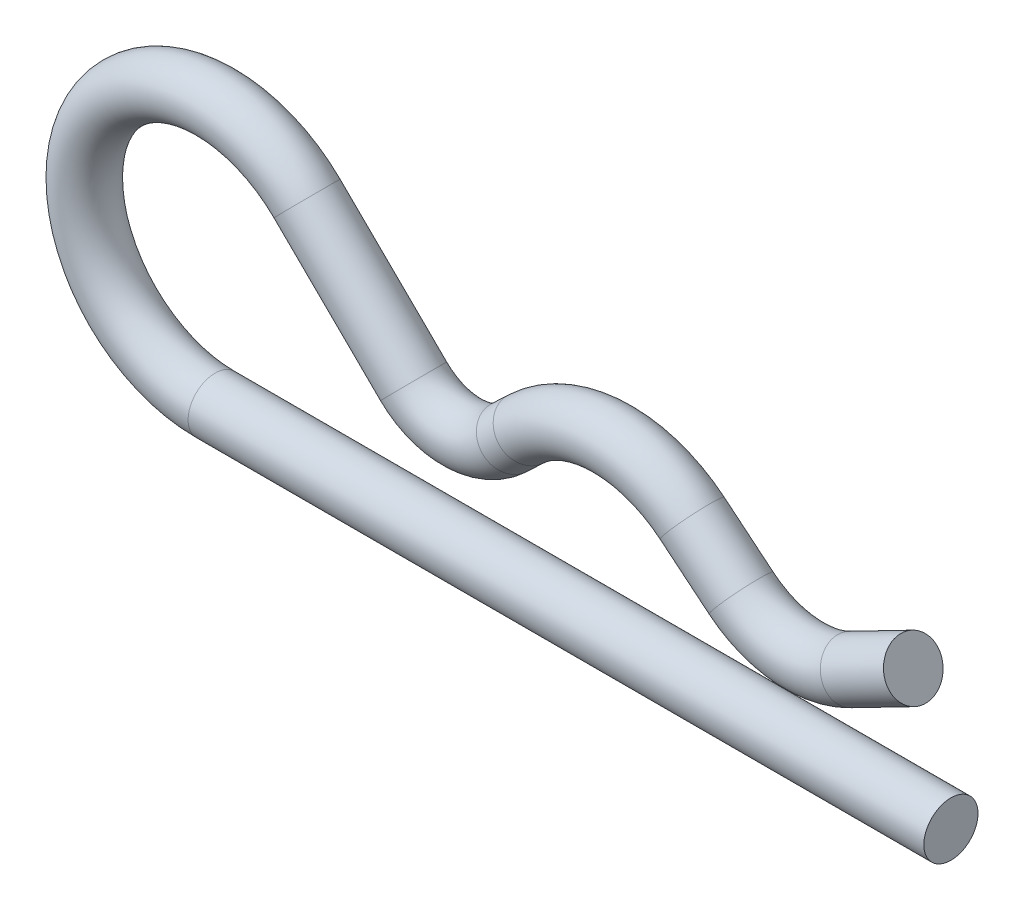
from build123d import *

# Parameters (mm, degrees)
SKETCH2_R = 0.9144


with BuildPart() as part:
    # Base-Sweep: sweep along a path in Sketch1
    with BuildLine(Plane.XY) as base_sweep_path:
        Line((0, 0), (-24.8412, 0))
        ThreePointArc((-24.8412, 0), (-28.930543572, 6.095945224), (-21.739040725, 7.567531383))
        Line((-21.739040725, 7.567531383), (-18.140285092, 4.021103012))
        ThreePointArc((-18.140285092, 4.021103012), (-16.53244586, 3.35290846), (-14.911992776, 3.989903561))
        Line((-14.911992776, 3.989903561), (-14.3450405, 4.527413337))
        ThreePointArc((-14.3450405, 4.527413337), (-11.576745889, 5.687057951), (-8.73481211, 4.721841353))
        Line((-8.73481211, 4.721841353), (-7.081149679, 3.358507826))
        ThreePointArc((-7.081149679, 3.358507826), (-5.301184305, 2.609929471), (-3.403028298, 2.964400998))
        Line((-3.403028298, 2.964400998), (-1.27, 4.064))
    # Sketch2 → Base-Sweep (sweep)
    with BuildSketch(Plane(origin=(0, 0, 0), x_dir=(0, 0, -1), z_dir=(1, 0, 0))):
        Circle(SKETCH2_R)
    sweep(path=base_sweep_path.line)


solid = part.part
